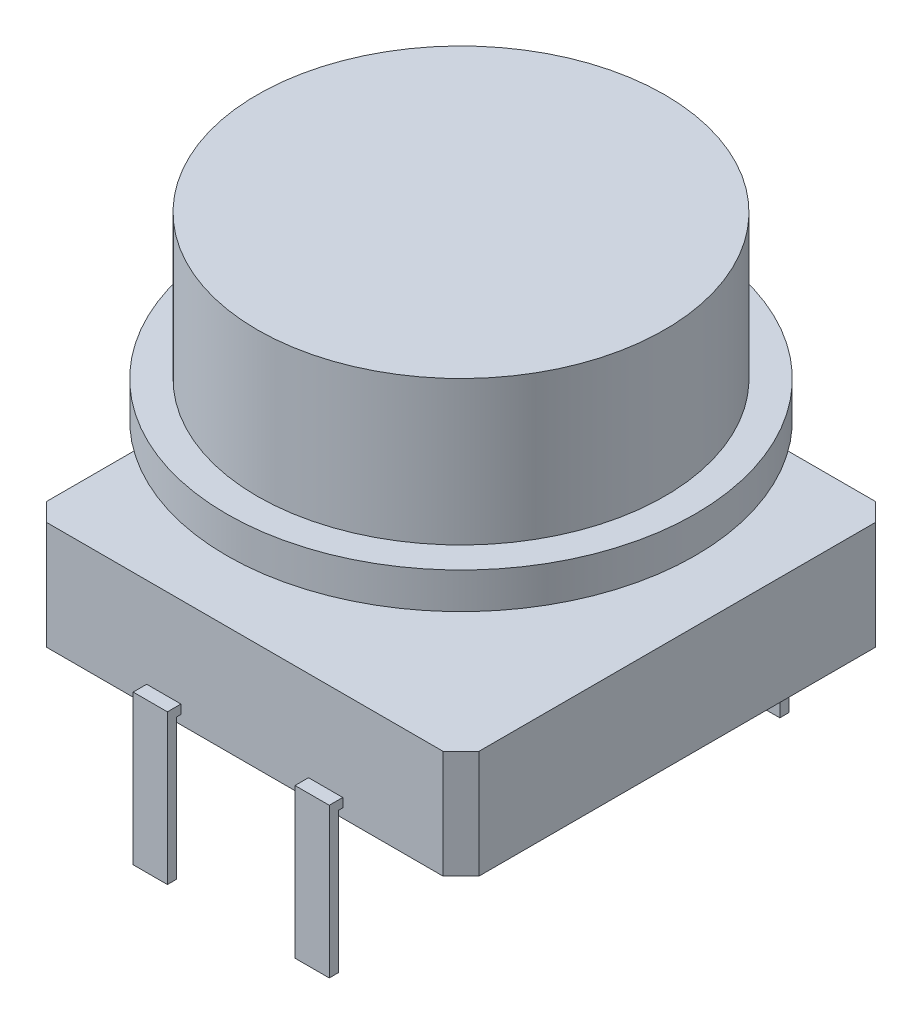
from build123d import *

# Parameters (mm, degrees)
BOSS_EXTRUDE1_DEPTH  = 3
SKETCH2_R            = 3.375
BOSS_EXTRUDE2_DEPTH  = 0.2
SKETCH3_W            = 3.5
SKETCH3_H            = 3.5
BOSS_EXTRUDE3_DEPTH  = 2
SKETCH4_R            = 6.5
BOSS_EXTRUDE4_DEPTH  = 1
SKETCH5_R            = 5.65
BOSS_EXTRUDE5_DEPTH  = 4
BOSS_EXTRUDE6_DEPTH  = 0.95
MIRROR2_COPY_1_DEPTH = 0.95


with BuildPart() as part:
    # Sketch1 → Boss-Extrude1 (new body)
    with BuildSketch(Plane(origin=(0, 0, 0), x_dir=(1, 0, 0), z_dir=(0, 1, 0))):
        Polygon((-5.5, 6), (-6, 5.5), (-6, -5.5), (-5.5, -6), (5.5, -6), (6, -5.5), (6, 5.5), (5.5, 6), align=None)
    extrude(amount=BOSS_EXTRUDE1_DEPTH)

    # Sketch2 → Boss-Extrude2 (add)
    with BuildSketch(Plane(origin=(0, 3, 0), x_dir=(1, 0, 0), z_dir=(0, 1, 0))):
        with Locations(Location((0, 0, 0), (0, 0, 270))):
            Circle(SKETCH2_R)
    extrude(amount=BOSS_EXTRUDE2_DEPTH)

    # Sketch3 → Boss-Extrude3 (add)
    with BuildSketch(Plane(origin=(0, 3.2, 0), x_dir=(1, 0, 0), z_dir=(0, 1, 0))):
        Rectangle(SKETCH3_W, SKETCH3_H)
    extrude(amount=BOSS_EXTRUDE3_DEPTH)

    # Sketch4 → Boss-Extrude4 (add)
    with BuildSketch(Plane(origin=(0, 5.2, 0), x_dir=(1, 0, 0), z_dir=(0, 1, 0))):
        with Locations(Location((0, 0, 0), (0, 0, 270))):
            Circle(SKETCH4_R)
    extrude(amount=BOSS_EXTRUDE4_DEPTH)

    # Sketch5 → Boss-Extrude5 (add)
    with BuildSketch(Plane(origin=(0, 6.2, 0), x_dir=(1, 0, 0), z_dir=(0, 1, 0))):
        with Locations(Location((0, 0, 0), (0, 0, 270))):
            Circle(SKETCH5_R)
    extrude(amount=BOSS_EXTRUDE5_DEPTH)

    # Sketch7 → Boss-Extrude6 (add)
    with BuildSketch(Plane.ZY.offset(2.72)):
        Polygon((6.375, 0.5), (6, 0.5), (6, 0.25), (6.125, 0.25), (6.125, -3.65), (6.375, -3.65), align=None)
    boss_extrude6 = extrude(amount=-BOSS_EXTRUDE6_DEPTH)

    # Mirror1: Boss-Extrude6 across plane
    add(boss_extrude6.mirror(Plane.ZY))

    # Mirror2: Boss-Extrude6 across plane
    add(boss_extrude6.mirror(Plane.XY))

    # Mirror2 copy 1 sketch → Mirror2 copy 1 (add)
    with BuildSketch(Plane(origin=(2.72, 0, 0), x_dir=(0, 0, -1), z_dir=(1, 0, 0))):
        Polygon((6.375, 0.5), (6, 0.5), (6, 0.25), (6.125, 0.25), (6.125, -3.65), (6.375, -3.65), align=None)
    extrude(amount=-MIRROR2_COPY_1_DEPTH)


solid = part.part
